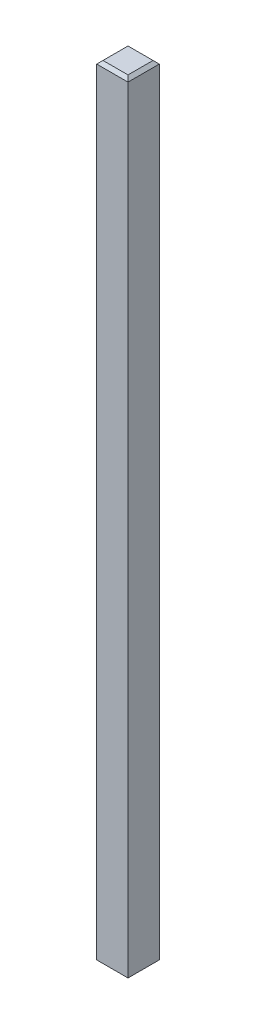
from build123d import *

# Parameters (mm, degrees)
ESQUISSE1_W        = 10
ESQUISSE1_H        = 250
BOSS_EXTRU_1_DEPTH = 10
CHANFREIN1_SIZE    = 1


with BuildPart() as part:
    # Esquisse1 → Boss.-Extru.1 (new body)
    with BuildSketch(Plane.XY):
        with Locations((5, 125)):
            Rectangle(ESQUISSE1_W, ESQUISSE1_H)
    extrude(amount=BOSS_EXTRU_1_DEPTH)

    # Chanfrein1
    chanfrein1_edges = [part.edges().sort_by_distance(p)[0] for p in [
        (5, 250, 10),
        (5, 250, 0),
        (5, 0, 0),
        (0, 250, 5),
        (10, 250, 5),
        (10, 0, 5),
        (0, 0, 5),
        (5, 0, 10),
    ]]
    chamfer(chanfrein1_edges, length=CHANFREIN1_SIZE)


solid = part.part
